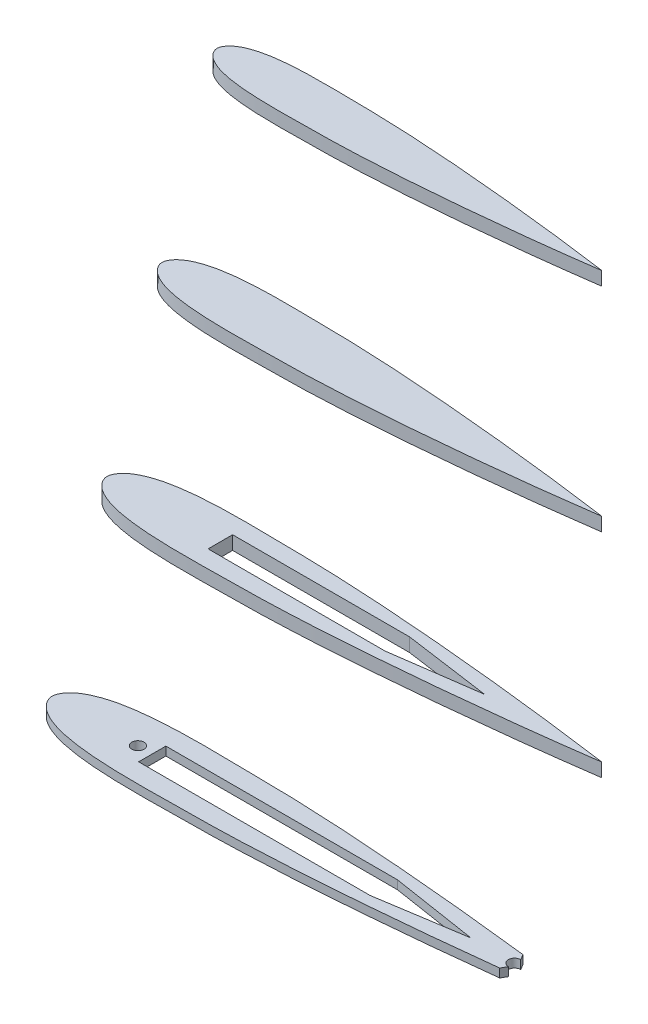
from build123d import *

# Parameters (mm, degrees)
BOSS_EXTRUDE1_DEPTH     = 3.175
BOSS_EXTRUDE2_DEPTH     = 5
BOSS_EXTRUDE3_DEPTH     = 5
BOSS_EXTRUDE5_DEPTH     = 5
SKETCH6_R               = 2.25
CUT_EXTRUDE1_DEPTH      = 5
SKETCH9_R               = 2.25
CUT_EXTRUDE3_DEPTH      = 312.582619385
CUT_EXTRUDE2_DEPTH      = 5
CUT_EXTRUDE5_DEPTH      = 312.582619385
CUT_EXTRUDE5_DEPTH_BACK = 312.582619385
SKETCH12_W              = 35.970833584
SKETCH12_H              = 21.356548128
CUT_EXTRUDE6_DEPTH      = 312.582619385
CUT_EXTRUDE6_DEPTH_BACK = 312.582619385


with BuildPart() as part:
    # Sketch1 → Boss-Extrude1 (new body)
    with BuildSketch(Plane(origin=(0, 0, 0), x_dir=(1, 0, 0), z_dir=(0, 1, 0))):
        with BuildLine():
            Line((-1.044957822, -0.582550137), (-1.018025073, -0.599251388))
            add(Edge.make_bspline(
                [(-1.044957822, -0.582550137), (-4.962147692, -0.042853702), (-12.207497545, 0.963170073), (-22.794340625, 2.313346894), (-32.794452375, 3.524923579), (-46.123743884, 5.042572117), (-59.457395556, 6.432586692), (-72.795059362, 7.686293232), (-82.795271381, 8.546094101), (-92.795121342, 9.327139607), (-102.861872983, 10.01587317), (-112.92832321, 10.605261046), (-122.995842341, 11.04164797), (-132.996498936, 11.364088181), (-141.265983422, 11.358452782), (-147.864973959, 11.512128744), (-156.131820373, 11.627243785), (-166.140902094, 11.63228144), (-176.148972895, 11.103774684), (-182.481164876, 10.398860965), (-186.823121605, 9.68691299), (-190.159163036, 8.927714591), (-192.817938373, 8.1238624), (-194.830307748, 7.388365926), (-196.85450306, 6.466090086), (-198.914546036, 5.257640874), (-200.623404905, 3.844361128), (-202.128419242, 1.952623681), (-203.236182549, -0.592756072), (-202.128419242, -3.138135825), (-200.623404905, -5.029873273), (-198.914546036, -6.443153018), (-196.85450306, -7.65160223), (-194.830307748, -8.57387807), (-192.817938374, -9.309374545), (-190.159163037, -10.113226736), (-186.823121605, -10.872425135), (-182.481164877, -11.58437311), (-176.148972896, -12.28928683), (-166.140902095, -12.817793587), (-156.131820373, -12.812755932), (-147.86497396, -12.697640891), (-141.265983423, -12.54396493), (-132.996498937, -12.549600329), (-122.995842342, -12.227160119), (-112.928323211, -11.790773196), (-102.861872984, -11.20138532), (-92.795121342, -10.512651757), (-82.795271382, -9.731606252), (-72.795059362, -8.871805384), (-59.457395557, -7.618098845), (-46.123743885, -6.228084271), (-32.794452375, -4.710435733), (-22.794340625, -3.498859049), (-12.198507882, -2.147535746), (-4.944195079, -1.140165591), (-1.018025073, -0.599251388)],
                knots=[-0.004320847, -0.004320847, -0.004320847, -0.004320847, 0.024634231, 0.04924287, 0.07382978, 0.098396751, 0.147478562, 0.171994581, 0.196493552, 0.220976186, 0.245442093, 0.270380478, 0.294812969, 0.319231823, 0.343641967, 0.355360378, 0.36756608, 0.404182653, 0.428636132, 0.440920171, 0.450818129, 0.460843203, 0.465945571, 0.471149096, 0.476522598, 0.482208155, 0.488618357, 0.492567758, 0.5, 0.507432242, 0.511381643, 0.517791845, 0.523477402, 0.528850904, 0.534054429, 0.539156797, 0.549181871, 0.559079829, 0.571363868, 0.595817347, 0.63243392, 0.644639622, 0.656358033, 0.680768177, 0.705187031, 0.729619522, 0.754557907, 0.779023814, 0.803506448, 0.828005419, 0.852521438, 0.901603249, 0.92617022, 0.95075713, 0.975365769, 1.004387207, 1.004387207, 1.004387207, 1.004387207], degree=3))
        make_face()
    extrude(amount=BOSS_EXTRUDE1_DEPTH)

    # Sketch6 → Cut-Extrude1 (cut)
    with BuildSketch(Plane(origin=(0, 0, 0), x_dir=(1, 0, 0), z_dir=(0, 1, 0))):
        with Locations(Location((-33.044957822, -0.582550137, 0), (0, 0, 270))):
            Circle(SKETCH6_R)
        Polygon((-81.044957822, 4.417449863), (-49.063396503, -0.582550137), (-81.044957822, -5.582550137), (-166.044957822, -5.582550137), (-166.044957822, -0.582550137), (-166.044957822, 4.417449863), align=None)
    extrude(amount=CUT_EXTRUDE1_DEPTH, mode=Mode.SUBTRACT)

    # Sketch9 → Cut-Extrude3 (cut, through all)
    with BuildSketch(Plane(origin=(0, 3.175, 0), x_dir=(1, 0, 0), z_dir=(0, 1, 0))):
        with Locations(Location((-171.294957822, -0.582550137, 0), (0, 0, 270))):
            Circle(SKETCH9_R)
    extrude(amount=-CUT_EXTRUDE3_DEPTH, mode=Mode.SUBTRACT)

    # Sketch12 → Cut-Extrude5 (cut, two sides: drawn at the far end of the back side and taken through both)
    with BuildSketch(Plane(origin=(0, 3.175, 0), x_dir=(1, 0, 0), z_dir=(0, 1, 0)).offset(-CUT_EXTRUDE5_DEPTH_BACK)):
        with Locations((-15.05954103, -1.619227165)):
            Rectangle(SKETCH12_W, SKETCH12_H)
    extrude(amount=CUT_EXTRUDE5_DEPTH + CUT_EXTRUDE5_DEPTH_BACK, mode=Mode.SUBTRACT)

    # Sketch13 → Cut-Extrude6 (cut, two sides: drawn at the far end of the back side and taken through both)
    with BuildSketch(Plane(origin=(0, 3.175, 0), x_dir=(1, 0, 0), z_dir=(0, 1, 0)).offset(-CUT_EXTRUDE6_DEPTH_BACK)):
        with BuildLine():
            Line((-33.044957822, 1.667449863), (-34.205672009, 3.677865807))
            add(Edge.make_bspline(
                [(-33.044957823, 3.542173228), (-33.431843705, 3.587564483), (-33.818748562, 3.6327946), (-34.205672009, 3.677865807)],
                knots=[0.074435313, 0.074435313, 0.074435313, 0.074435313, 0.077287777, 0.077287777, 0.077287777, 0.077287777], degree=3))
            Line((-33.044957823, 3.542173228), (-33.044957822, 1.667449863))
        make_face()
        with BuildLine():
            Line((-33.044957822, -2.832550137), (-34.21830649, -4.864849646))
            add(Edge.make_bspline(
                [(-34.21830649, -4.864849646), (-33.827171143, -4.819291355), (-33.436054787, -4.773570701), (-33.044957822, -4.727685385)],
                knots=[0.922681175, 0.922681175, 0.922681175, 0.922681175, 0.925564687, 0.925564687, 0.925564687, 0.925564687], degree=3))
            Line((-33.044957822, -4.727685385), (-33.044957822, -2.832550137))
        make_face()
    extrude(amount=CUT_EXTRUDE6_DEPTH + CUT_EXTRUDE6_DEPTH_BACK, mode=Mode.SUBTRACT)


with BuildPart() as body_2:
    # Sketch3 → Boss-Extrude2 (new body)
    with BuildSketch(Plane(origin=(0, 78.126, 0), x_dir=(1, 0, 0), z_dir=(0, 1, 0))):
        with BuildLine():
            Line((-1.044957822, -0.582550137), (-1.020718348, -0.597581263))
            add(Edge.make_bspline(
                [(-1.044957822, -0.582550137), (-4.570428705, -0.096823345), (-11.091243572, 0.808598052), (-20.619402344, 2.02375719), (-29.61950292, 3.114176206), (-41.615865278, 4.480059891), (-53.616151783, 5.731073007), (-65.620049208, 6.859408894), (-74.620240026, 7.633229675), (-83.62010499, 8.33617063), (-92.680181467, 8.956030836), (-101.739986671, 9.486479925), (-110.800753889, 9.879228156), (-119.801344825, 10.169424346), (-127.243880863, 10.164352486), (-133.182972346, 10.302660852), (-140.623134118, 10.406264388), (-149.631307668, 10.410798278), (-158.638571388, 9.935142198), (-164.337544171, 9.30071985), (-168.245305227, 8.659966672), (-171.247742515, 7.976688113), (-173.640640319, 7.253221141), (-175.451772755, 6.591274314), (-177.273548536, 5.761226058), (-179.127587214, 4.673621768), (-180.665560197, 3.401669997), (-182.0200731, 1.699106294), (-183.017060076, -0.591735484), (-182.0200731, -2.882577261), (-180.665560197, -4.585140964), (-179.127587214, -5.857092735), (-177.273548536, -6.944697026), (-175.451772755, -7.774745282), (-173.640640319, -8.436692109), (-171.247742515, -9.160159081), (-168.245305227, -9.84343764), (-164.337544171, -10.484190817), (-158.638571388, -11.118613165), (-149.631307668, -11.594269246), (-140.623134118, -11.589735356), (-133.182972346, -11.48613182), (-127.243880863, -11.347823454), (-119.801344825, -11.352895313), (-110.800753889, -11.062699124), (-101.739986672, -10.669950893), (-92.680181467, -10.139501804), (-83.62010499, -9.519641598), (-74.620240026, -8.816700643), (-65.620049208, -8.042879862), (-53.616151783, -6.914543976), (-41.615865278, -5.663530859), (-29.61950292, -4.297647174), (-20.619402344, -3.207228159), (-11.083152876, -1.991037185), (-4.554271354, -1.084404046), (-1.020718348, -0.597581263)],
                knots=[-0.004320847, -0.004320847, -0.004320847, -0.004320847, 0.024634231, 0.04924287, 0.07382978, 0.098396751, 0.147478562, 0.171994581, 0.196493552, 0.220976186, 0.245442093, 0.270380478, 0.294812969, 0.319231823, 0.343641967, 0.355360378, 0.36756608, 0.404182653, 0.428636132, 0.440920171, 0.450818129, 0.460843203, 0.465945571, 0.471149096, 0.476522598, 0.482208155, 0.488618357, 0.492567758, 0.5, 0.507432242, 0.511381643, 0.517791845, 0.523477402, 0.528850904, 0.534054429, 0.539156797, 0.549181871, 0.559079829, 0.571363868, 0.595817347, 0.63243392, 0.644639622, 0.656358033, 0.680768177, 0.705187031, 0.729619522, 0.754557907, 0.779023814, 0.803506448, 0.828005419, 0.852521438, 0.901603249, 0.92617022, 0.95075713, 0.975365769, 1.004387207, 1.004387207, 1.004387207, 1.004387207], degree=3))
        make_face()
    extrude(amount=BOSS_EXTRUDE2_DEPTH)

    # Sketch7 → Cut-Extrude2 (cut)
    with BuildSketch(Plane(origin=(0, 78.126, 0), x_dir=(1, 0, 0), z_dir=(0, 1, 0))):
        Polygon((-76.044957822, 3.917449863), (-44.05761296, -0.582550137), (-76.044957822, -5.082550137), (-141.044957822, -5.082550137), (-141.044957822, -0.582550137), (-141.044957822, 3.917449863), align=None)
    extrude(amount=CUT_EXTRUDE2_DEPTH, mode=Mode.SUBTRACT)


with BuildPart() as body_3:
    # Sketch4 → Boss-Extrude3 (new body)
    with BuildSketch(Plane(origin=(0, 156.252, 0), x_dir=(1, 0, 0), z_dir=(0, 1, 0))):
        with BuildLine():
            Line((-1.044957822, -0.582550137), (-1.023411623, -0.595911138))
            add(Edge.make_bspline(
                [(-1.044957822, -0.582550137), (-4.178709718, -0.150792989), (-9.9749896, 0.654026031), (-18.444464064, 1.734167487), (-26.444553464, 2.703428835), (-37.107986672, 3.917547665), (-47.77490801, 5.029559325), (-58.445039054, 6.032524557), (-66.44520867, 6.720365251), (-74.445088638, 7.345201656), (-82.498489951, 7.896188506), (-90.551650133, 8.367698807), (-98.605665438, 8.716808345), (-106.606190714, 8.974760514), (-113.221778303, 8.970252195), (-118.500970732, 9.093192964), (-125.114447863, 9.185284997), (-133.12171324, 9.189315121), (-141.128169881, 8.766509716), (-146.193923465, 8.20257874), (-149.667488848, 7.63302036), (-152.336321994, 7.025661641), (-154.463342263, 6.382579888), (-156.073237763, 5.794182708), (-157.692594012, 5.056362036), (-159.340628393, 4.089602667), (-160.707715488, 2.958978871), (-161.911726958, 1.445588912), (-162.797937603, -0.59071489), (-161.911726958, -2.627018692), (-160.707715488, -4.14040865), (-159.340628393, -5.271032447), (-157.692594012, -6.237791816), (-156.073237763, -6.975612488), (-154.463342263, -7.564009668), (-152.336321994, -8.20709142), (-149.667488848, -8.81445014), (-146.193923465, -9.38400852), (-141.128169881, -9.947939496), (-133.12171324, -10.370744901), (-125.114447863, -10.366714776), (-118.500970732, -10.274622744), (-113.221778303, -10.151681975), (-106.606190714, -10.156190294), (-98.605665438, -9.898238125), (-90.551650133, -9.549128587), (-82.498489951, -9.077618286), (-74.445088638, -8.526631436), (-66.44520867, -7.901795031), (-58.445039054, -7.213954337), (-47.77490801, -6.210989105), (-37.107986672, -5.098977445), (-26.444553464, -3.884858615), (-18.444464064, -2.915597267), (-9.96779787, -1.834538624), (-4.164347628, -1.0286425), (-1.023411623, -0.595911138)],
                knots=[-0.004320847, -0.004320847, -0.004320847, -0.004320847, 0.024634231, 0.04924287, 0.07382978, 0.098396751, 0.147478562, 0.171994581, 0.196493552, 0.220976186, 0.245442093, 0.270380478, 0.294812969, 0.319231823, 0.343641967, 0.355360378, 0.36756608, 0.404182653, 0.428636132, 0.440920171, 0.450818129, 0.460843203, 0.465945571, 0.471149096, 0.476522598, 0.482208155, 0.488618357, 0.492567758, 0.5, 0.507432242, 0.511381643, 0.517791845, 0.523477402, 0.528850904, 0.534054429, 0.539156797, 0.549181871, 0.559079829, 0.571363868, 0.595817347, 0.63243392, 0.644639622, 0.656358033, 0.680768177, 0.705187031, 0.729619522, 0.754557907, 0.779023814, 0.803506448, 0.828005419, 0.852521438, 0.901603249, 0.92617022, 0.95075713, 0.975365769, 1.004387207, 1.004387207, 1.004387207, 1.004387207], degree=3))
        make_face()
    extrude(amount=BOSS_EXTRUDE3_DEPTH)


with BuildPart() as body_4:
    # Sketch2 → Boss-Extrude5 (new body)
    with BuildSketch(Plane(origin=(0, 234.38, 0), x_dir=(1, 0, 0), z_dir=(0, 1, 0))):
        with BuildLine():
            Line((-1.044957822, -0.582550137), (-1.026104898, -0.594241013))
            add(Edge.make_bspline(
                [(-1.044957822, -0.582550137), (-3.786990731, -0.204762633), (-8.858735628, 0.49945401), (-16.269525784, 1.444577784), (-23.269604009, 2.292681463), (-32.600108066, 3.35503544), (-41.933664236, 4.328045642), (-51.2700289, 5.20564022), (-58.270177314, 5.807500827), (-65.270072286, 6.354232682), (-72.316798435, 6.836346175), (-79.363313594, 7.248917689), (-86.410576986, 7.554388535), (-93.411036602, 7.780096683), (-99.199675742, 7.776151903), (-103.818969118, 7.883725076), (-109.605761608, 7.964305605), (-116.612118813, 7.967831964), (-123.617768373, 7.597877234), (-128.05030276, 7.10443763), (-131.08967247, 6.606074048), (-133.424901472, 6.074635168), (-135.286044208, 5.511938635), (-136.69470277, 4.997091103), (-138.111639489, 4.351498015), (-139.553669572, 3.505583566), (-140.74987078, 2.516287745), (-141.803380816, 1.192071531), (-142.578815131, -0.589694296), (-141.803380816, -2.371460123), (-140.74987078, -3.695676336), (-139.553669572, -4.684972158), (-138.111639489, -5.530886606), (-136.69470277, -6.176479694), (-135.286044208, -6.691327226), (-133.424901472, -7.25402376), (-131.08967247, -7.785462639), (-128.05030276, -8.283826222), (-123.617768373, -8.777265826), (-116.612118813, -9.147220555), (-109.605761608, -9.143694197), (-103.818969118, -9.063113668), (-99.199675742, -8.955540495), (-93.411036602, -8.959485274), (-86.410576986, -8.733777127), (-79.363313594, -8.42830628), (-72.316798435, -8.015734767), (-65.270072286, -7.533621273), (-58.270177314, -6.986889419), (-51.2700289, -6.385028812), (-41.933664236, -5.507434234), (-32.600108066, -4.534424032), (-23.269604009, -3.472070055), (-16.269525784, -2.623966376), (-8.852442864, -1.678040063), (-3.774423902, -0.972880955), (-1.026104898, -0.594241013)],
                knots=[-0.004320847, -0.004320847, -0.004320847, -0.004320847, 0.024634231, 0.04924287, 0.07382978, 0.098396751, 0.147478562, 0.171994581, 0.196493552, 0.220976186, 0.245442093, 0.270380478, 0.294812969, 0.319231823, 0.343641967, 0.355360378, 0.36756608, 0.404182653, 0.428636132, 0.440920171, 0.450818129, 0.460843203, 0.465945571, 0.471149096, 0.476522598, 0.482208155, 0.488618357, 0.492567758, 0.5, 0.507432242, 0.511381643, 0.517791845, 0.523477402, 0.528850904, 0.534054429, 0.539156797, 0.549181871, 0.559079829, 0.571363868, 0.595817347, 0.63243392, 0.644639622, 0.656358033, 0.680768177, 0.705187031, 0.729619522, 0.754557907, 0.779023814, 0.803506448, 0.828005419, 0.852521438, 0.901603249, 0.92617022, 0.95075713, 0.975365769, 1.004387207, 1.004387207, 1.004387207, 1.004387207], degree=3))
        make_face()
    extrude(amount=BOSS_EXTRUDE5_DEPTH)


solid = Compound([part.part, body_2.part, body_3.part, body_4.part])
